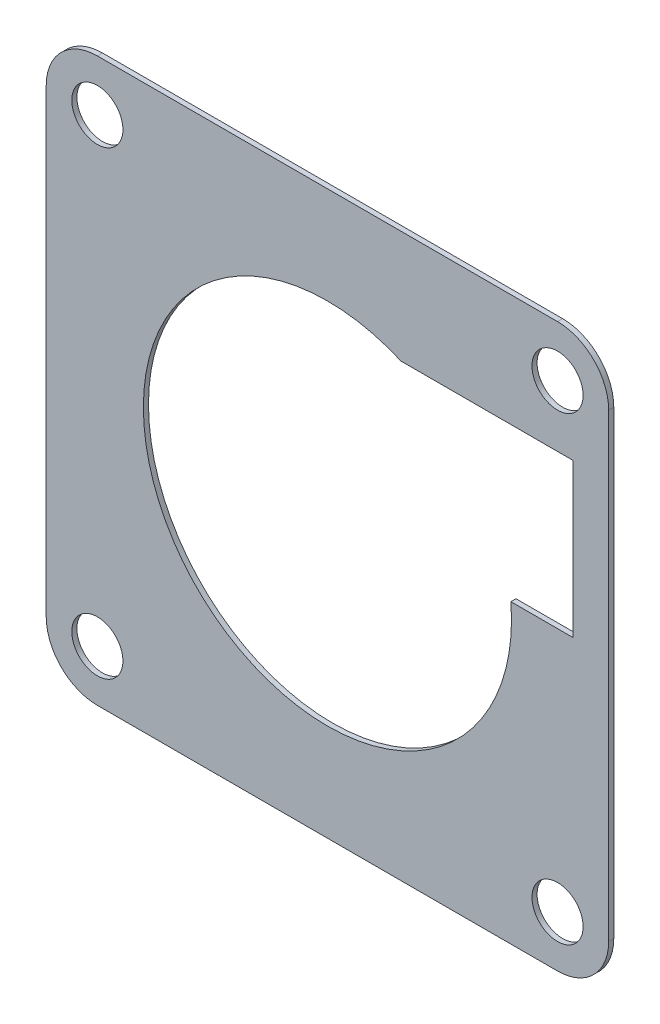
from build123d import *

# Parameters (mm, degrees)
ESQUISSE1_W             = 55
ESQUISSE1_H             = 55
BASE_EXTRUSION_DEPTH    = 0.5
CONG_1_R                = 5
ESQUISSE2_R             = 2.5
ENL_V_MAT_EXTRU_1_DEPTH = 39.894086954
ENL_V_MAT_EXTRU_2_DEPTH = 39.894086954


with BuildPart() as part:
    # Esquisse1 → Base-Extrusion (new body)
    with BuildSketch(Plane.XY):
        Rectangle(ESQUISSE1_W, ESQUISSE1_H)
    extrude(amount=BASE_EXTRUSION_DEPTH)

    # Cong_1
    cong_1_edges = [part.edges().sort_by_distance(p)[0] for p in [
        (-27.5, 27.5, 0.25),
        (27.5, 27.5, 0.25),
        (27.5, -27.5, 0.25),
        (-27.5, -27.5, 0.25),
    ]]
    fillet(cong_1_edges, radius=CONG_1_R)

    # Esquisse2 → Enl_v. mat.-Extru.1 (cut, through all)
    with BuildSketch(Plane.XY.offset(0.5)):
        with Locations((-22.5, 22.5)):
            Circle(ESQUISSE2_R)
        with Locations(Location((22.5, 22.5, 0), (0, 0, 180))):
            Circle(ESQUISSE2_R)
        with Locations((22.5, -22.5)):
            Circle(ESQUISSE2_R)
        with Locations(Location((-22.5, -22.5, 0), (0, 0, 180))):
            Circle(ESQUISSE2_R)
    extrude(amount=-ENL_V_MAT_EXTRU_1_DEPTH, mode=Mode.SUBTRACT)

    # Esquisse3 → Enl_v. mat.-Extru.2 (cut, through all)
    with BuildSketch(Plane.XY.offset(0.5)):
        with BuildLine():
            Line((7.193747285, 16.5), (24, 16.5))
            Line((24, 16.5), (24, 1.5))
            Line((24, 1.5), (17.937391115, 1.5))
            ThreePointArc((17.937391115, 1.5), (-14.633643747, -10.481243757), (7.193747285, 16.5))
        make_face()
    extrude(amount=-ENL_V_MAT_EXTRU_2_DEPTH, mode=Mode.SUBTRACT)


solid = part.part
